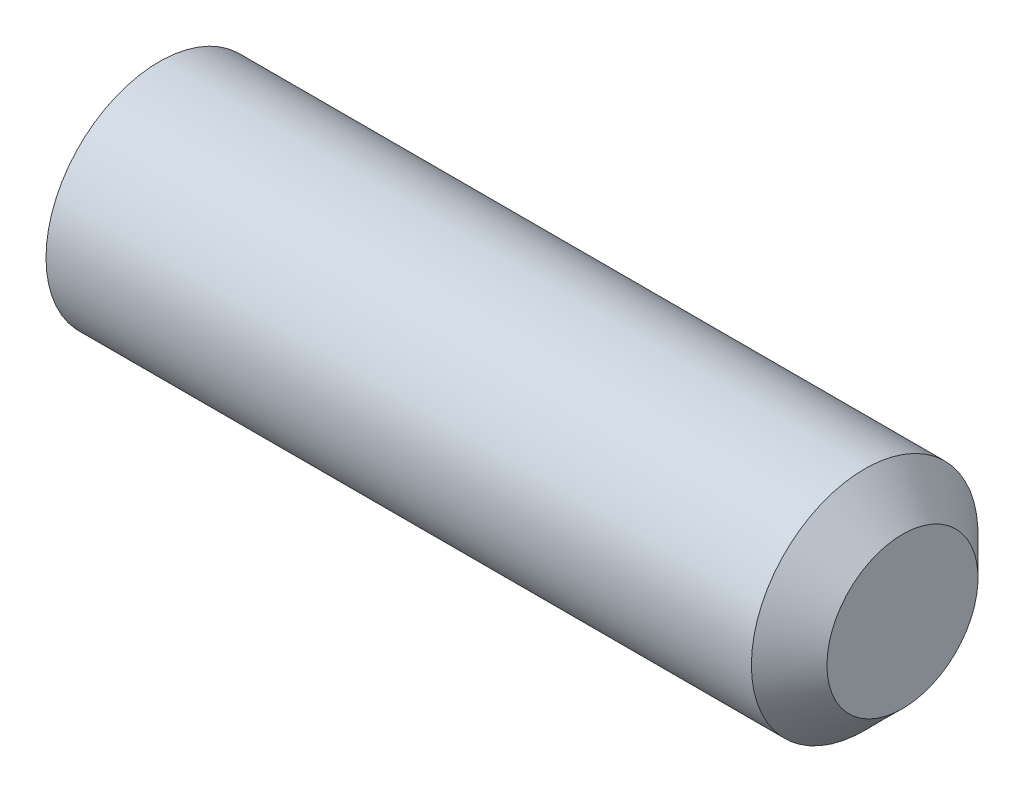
from build123d import *

# Parameters (mm, degrees)
HEX_2_DEPTH = 1.2


with BuildPart() as part:
    # BodySke → BaseBody (revolve)
    with BuildSketch(Plane.XY, mode=Mode.PRIVATE) as basebody_sk:
        Polygon((0, 0), (0, 1.2195), (0.161946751, 1.5), (9.5, 1.5), (10, 1), (10, 0), align=None)
    revolve(basebody_sk.sketch.rotate(Axis((-12.7, 0, 0), (1, 0, 0)), 90), axis=Axis((-12.7, 0, 0), (1, 0, 0)))

    # Sketch2 → Hex 2 (cut)
    with BuildSketch(Plane.ZY):
        Polygon((0.433012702, 0.75), (-0.433012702, 0.75), (-0.866025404, 0), (-0.433012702, -0.75), (0.433012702, -0.75), (0.866025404, 0), align=None)
    extrude(amount=-HEX_2_DEPTH, mode=Mode.SUBTRACT)


solid = part.part
